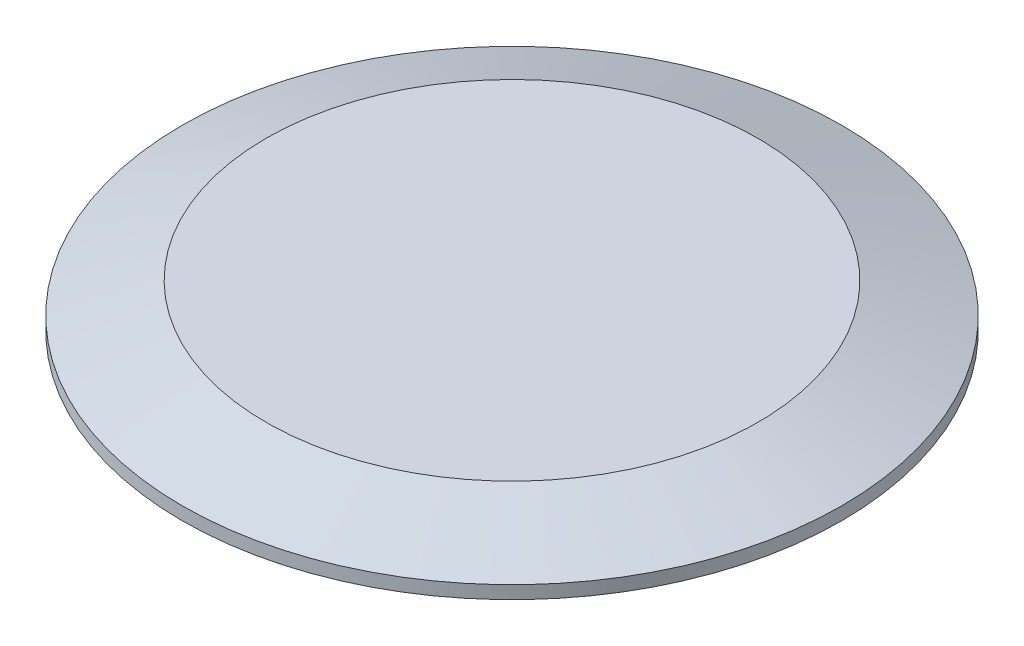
ISO-10303-21;
HEADER;
FILE_DESCRIPTION(('STEP AP214'),'2;1');
FILE_NAME('part.step','',(''),(''),'','','');
FILE_SCHEMA(('AUTOMOTIVE_DESIGN { 1 0 10303 214 1 1 1 1 }'));
ENDSEC;
DATA;
#1=APPLICATION_CONTEXT('core data for automotive mechanical design processes');
#2=APPLICATION_PROTOCOL_DEFINITION('international standard','automotive_design',2000,#1);
#3=PRODUCT_CONTEXT('',#1,'mechanical');
#4=PRODUCT('Part','Part','',(#3));
#5=PRODUCT_RELATED_PRODUCT_CATEGORY('part','',(#4));
#6=PRODUCT_DEFINITION_FORMATION('','',#4);
#7=PRODUCT_DEFINITION_CONTEXT('part definition',#1,'design');
#8=PRODUCT_DEFINITION('design','',#6,#7);
#9=PRODUCT_DEFINITION_SHAPE('','',#8);
#10=(LENGTH_UNIT() NAMED_UNIT(*) SI_UNIT(.MILLI.,.METRE.));
#11=(NAMED_UNIT(*) PLANE_ANGLE_UNIT() SI_UNIT($,.RADIAN.));
#12=(NAMED_UNIT(*) SI_UNIT($,.STERADIAN.) SOLID_ANGLE_UNIT());
#13=UNCERTAINTY_MEASURE_WITH_UNIT(LENGTH_MEASURE(1.E-05),#10,'distance_accuracy_value','');
#14=(GEOMETRIC_REPRESENTATION_CONTEXT(3) GLOBAL_UNCERTAINTY_ASSIGNED_CONTEXT((#13)) GLOBAL_UNIT_ASSIGNED_CONTEXT((#10,
#11,#12)) REPRESENTATION_CONTEXT('',''));
#15=CARTESIAN_POINT('',(0.,0.,0.));
#16=DIRECTION('',(0.,0.,1.));
#17=DIRECTION('',(1.,0.,0.));
#18=AXIS2_PLACEMENT_3D('',#15,#16,#17);
#19=CARTESIAN_POINT('',(-53.9347013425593,9.525,0.));
#20=DIRECTION('',(0.,1.,0.));
#21=DIRECTION('',(-1.,0.,0.));
#22=AXIS2_PLACEMENT_3D('',#19,#20,#21);
#23=PLANE('',#22);
#24=CARTESIAN_POINT('',(0.,9.52500000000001,0.));
#25=DIRECTION('',(0.,1.,0.));
#26=DIRECTION('',(-1.,0.,0.));
#27=AXIS2_PLACEMENT_3D('',#24,#25,#26);
#28=CIRCLE('',#27,53.9347013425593);
#29=CARTESIAN_POINT('',(-53.9347013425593,9.525,0.));
#30=VERTEX_POINT('',#29);
#31=EDGE_CURVE('E10',#30,#30,#28,.T.);
#32=ORIENTED_EDGE('',*,*,#31,.T.);
#33=EDGE_LOOP('',(#32));
#34=FACE_BOUND('',#33,.T.);
#35=ADVANCED_FACE('F31',(#34),#23,.T.);
#36=CARTESIAN_POINT('',(0.,9.52500000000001,0.));
#37=DIRECTION('',(0.,-1.,0.));
#38=DIRECTION('',(1.,0.,0.));
#39=AXIS2_PLACEMENT_3D('',#36,#37,#38);
#40=CONICAL_SURFACE('',#39,53.9347013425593,1.22173047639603);
#41=CARTESIAN_POINT('',(0.,2.8448,0.));
#42=DIRECTION('',(0.,1.,0.));
#43=DIRECTION('',(-1.,0.,0.));
#44=AXIS2_PLACEMENT_3D('',#41,#42,#43);
#45=CIRCLE('',#44,72.2884);
#46=CARTESIAN_POINT('',(-72.2884,2.84479999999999,0.));
#47=VERTEX_POINT('',#46);
#48=EDGE_CURVE('E37',#47,#47,#45,.T.);
#49=ORIENTED_EDGE('',*,*,#48,.T.);
#50=EDGE_LOOP('',(#49));
#51=FACE_BOUND('',#50,.T.);
#52=ORIENTED_EDGE('',*,*,#31,.F.);
#53=EDGE_LOOP('',(#52));
#54=FACE_BOUND('',#53,.T.);
#55=ADVANCED_FACE('F72',(#51,#54),#40,.T.);
#56=CARTESIAN_POINT('',(0.,9.525,0.));
#57=DIRECTION('',(0.,1.,0.));
#58=DIRECTION('',(-1.,0.,0.));
#59=AXIS2_PLACEMENT_3D('',#56,#57,#58);
#60=CYLINDRICAL_SURFACE('',#59,72.2884);
#61=CARTESIAN_POINT('',(0.,0.,0.));
#62=DIRECTION('',(0.,1.,0.));
#63=DIRECTION('',(-1.,0.,0.));
#64=AXIS2_PLACEMENT_3D('',#61,#62,#63);
#65=CIRCLE('',#64,72.2884);
#66=CARTESIAN_POINT('',(-72.2884,0.,0.));
#67=VERTEX_POINT('',#66);
#68=EDGE_CURVE('E41',#67,#67,#65,.T.);
#69=ORIENTED_EDGE('',*,*,#68,.T.);
#70=EDGE_LOOP('',(#69));
#71=FACE_BOUND('',#70,.T.);
#72=ORIENTED_EDGE('',*,*,#48,.F.);
#73=EDGE_LOOP('',(#72));
#74=FACE_BOUND('',#73,.T.);
#75=ADVANCED_FACE('F76',(#71,#74),#60,.T.);
#76=CARTESIAN_POINT('',(-69.2804084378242,0.,0.));
#77=DIRECTION('',(0.,-1.,0.));
#78=DIRECTION('',(1.,0.,0.));
#79=AXIS2_PLACEMENT_3D('',#76,#77,#78);
#80=PLANE('',#79);
#81=CARTESIAN_POINT('',(0.,0.,0.));
#82=DIRECTION('',(0.,1.,0.));
#83=DIRECTION('',(-1.,0.,0.));
#84=AXIS2_PLACEMENT_3D('',#81,#82,#83);
#85=CIRCLE('',#84,69.2804084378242);
#86=CARTESIAN_POINT('',(-69.2804084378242,0.,0.));
#87=VERTEX_POINT('',#86);
#88=EDGE_CURVE('E45',#87,#87,#85,.T.);
#89=ORIENTED_EDGE('',*,*,#88,.T.);
#90=EDGE_LOOP('',(#89));
#91=FACE_BOUND('',#90,.T.);
#92=ORIENTED_EDGE('',*,*,#68,.F.);
#93=EDGE_LOOP('',(#92));
#94=FACE_BOUND('',#93,.T.);
#95=ADVANCED_FACE('F80',(#91,#94),#80,.T.);
#96=CARTESIAN_POINT('',(0.,0.787400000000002,0.));
#97=DIRECTION('',(0.,1.,0.));
#98=DIRECTION('',(-1.,0.,0.));
#99=AXIS2_PLACEMENT_3D('',#96,#97,#98);
#100=TOROIDAL_SURFACE('',#99,69.2804084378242,0.787400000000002);
#101=CARTESIAN_POINT('',(0.,0.474458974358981,0.));
#102=DIRECTION('',(0.,1.,0.));
#103=DIRECTION('',(-1.,0.,0.));
#104=AXIS2_PLACEMENT_3D('',#101,#102,#103);
#105=CIRCLE('',#104,68.5578666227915);
#106=CARTESIAN_POINT('',(-68.5578666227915,0.474458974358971,0.));
#107=VERTEX_POINT('',#106);
#108=EDGE_CURVE('E50',#107,#107,#105,.T.);
#109=ORIENTED_EDGE('',*,*,#108,.T.);
#110=EDGE_LOOP('',(#109));
#111=FACE_BOUND('',#110,.T.);
#112=ORIENTED_EDGE('',*,*,#88,.F.);
#113=EDGE_LOOP('',(#112));
#114=FACE_BOUND('',#113,.T.);
#115=ADVANCED_FACE('F87',(#111,#114),#100,.T.);
#116=CARTESIAN_POINT('',(0.,0.,0.));
#117=DIRECTION('',(0.,1.,0.));
#118=DIRECTION('',(-1.,0.,0.));
#119=AXIS2_PLACEMENT_3D('',#116,#117,#118);
#120=TOROIDAL_SURFACE('',#119,67.4624,1.19380000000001);
#121=CARTESIAN_POINT('',(0.,0.474458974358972,0.));
#122=DIRECTION('',(0.,1.,0.));
#123=DIRECTION('',(-1.,0.,0.));
#124=AXIS2_PLACEMENT_3D('',#121,#122,#123);
#125=CIRCLE('',#124,66.3669333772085);
#126=CARTESIAN_POINT('',(-66.3669333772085,0.474458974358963,0.));
#127=VERTEX_POINT('',#126);
#128=EDGE_CURVE('E53',#127,#127,#125,.T.);
#129=ORIENTED_EDGE('',*,*,#128,.T.);
#130=EDGE_LOOP('',(#129));
#131=FACE_BOUND('',#130,.T.);
#132=ORIENTED_EDGE('',*,*,#108,.F.);
#133=EDGE_LOOP('',(#132));
#134=FACE_BOUND('',#133,.T.);
#135=ADVANCED_FACE('F69',(#131,#134),#120,.F.);
#136=CARTESIAN_POINT('',(0.,0.787400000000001,0.));
#137=DIRECTION('',(0.,1.,0.));
#138=DIRECTION('',(-1.,0.,0.));
#139=AXIS2_PLACEMENT_3D('',#136,#137,#138);
#140=TOROIDAL_SURFACE('',#139,65.6443915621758,0.78739999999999);
#141=CARTESIAN_POINT('',(0.,0.,0.));
#142=DIRECTION('',(0.,1.,0.));
#143=DIRECTION('',(-1.,0.,0.));
#144=AXIS2_PLACEMENT_3D('',#141,#142,#143);
#145=CIRCLE('',#144,65.6443915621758);
#146=CARTESIAN_POINT('',(-65.6443915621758,0.,0.));
#147=VERTEX_POINT('',#146);
#148=EDGE_CURVE('E56',#147,#147,#145,.T.);
#149=ORIENTED_EDGE('',*,*,#148,.T.);
#150=EDGE_LOOP('',(#149));
#151=FACE_BOUND('',#150,.T.);
#152=ORIENTED_EDGE('',*,*,#128,.F.);
#153=EDGE_LOOP('',(#152));
#154=FACE_BOUND('',#153,.T.);
#155=ADVANCED_FACE('F60',(#151,#154),#140,.T.);
#156=CARTESIAN_POINT('',(0.,0.,0.));
#157=DIRECTION('',(0.,-1.,0.));
#158=DIRECTION('',(1.,0.,0.));
#159=AXIS2_PLACEMENT_3D('',#156,#157,#158);
#160=PLANE('',#159);
#161=ORIENTED_EDGE('',*,*,#148,.F.);
#162=EDGE_LOOP('',(#161));
#163=FACE_BOUND('',#162,.T.);
#164=ADVANCED_FACE('F63',(#163),#160,.T.);
#165=CLOSED_SHELL('',(#35,#55,#75,#95,#115,#135,#155,#164));
#166=MANIFOLD_SOLID_BREP('B2',#165);
#167=ADVANCED_BREP_SHAPE_REPRESENTATION('',(#18,#166),#14);
#168=SHAPE_DEFINITION_REPRESENTATION(#9,#167);
ENDSEC;
END-ISO-10303-21;
